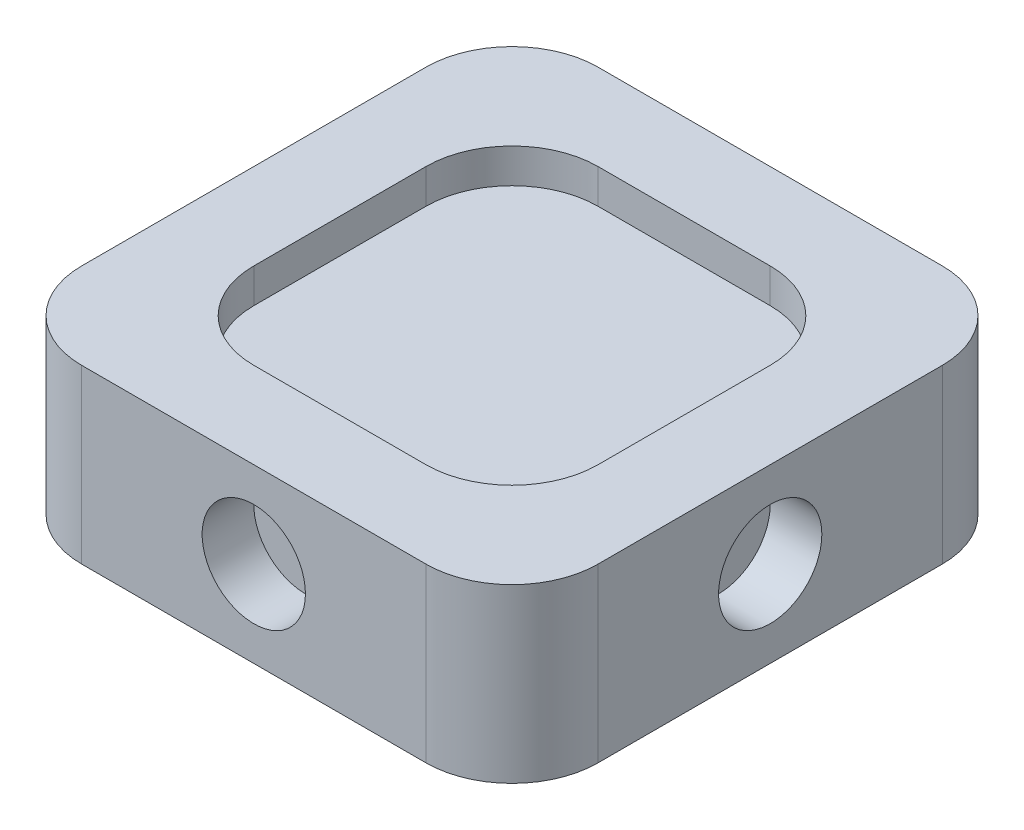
ISO-10303-21;
HEADER;
FILE_DESCRIPTION(('STEP AP214'),'2;1');
FILE_NAME('part.step','',(''),(''),'','','');
FILE_SCHEMA(('AUTOMOTIVE_DESIGN { 1 0 10303 214 1 1 1 1 }'));
ENDSEC;
DATA;
#1=APPLICATION_CONTEXT('core data for automotive mechanical design processes');
#2=APPLICATION_PROTOCOL_DEFINITION('international standard','automotive_design',2000,#1);
#3=PRODUCT_CONTEXT('',#1,'mechanical');
#4=PRODUCT('Part','Part','',(#3));
#5=PRODUCT_RELATED_PRODUCT_CATEGORY('part','',(#4));
#6=PRODUCT_DEFINITION_FORMATION('','',#4);
#7=PRODUCT_DEFINITION_CONTEXT('part definition',#1,'design');
#8=PRODUCT_DEFINITION('design','',#6,#7);
#9=PRODUCT_DEFINITION_SHAPE('','',#8);
#10=(LENGTH_UNIT() NAMED_UNIT(*) SI_UNIT(.MILLI.,.METRE.));
#11=(NAMED_UNIT(*) PLANE_ANGLE_UNIT() SI_UNIT($,.RADIAN.));
#12=(NAMED_UNIT(*) SI_UNIT($,.STERADIAN.) SOLID_ANGLE_UNIT());
#13=UNCERTAINTY_MEASURE_WITH_UNIT(LENGTH_MEASURE(1.E-05),#10,'distance_accuracy_value','');
#14=(GEOMETRIC_REPRESENTATION_CONTEXT(3) GLOBAL_UNCERTAINTY_ASSIGNED_CONTEXT((#13)) GLOBAL_UNIT_ASSIGNED_CONTEXT((#10,
#11,#12)) REPRESENTATION_CONTEXT('',''));
#15=CARTESIAN_POINT('',(0.,0.,0.));
#16=DIRECTION('',(0.,0.,1.));
#17=DIRECTION('',(1.,0.,0.));
#18=AXIS2_PLACEMENT_3D('',#15,#16,#17);
#19=CARTESIAN_POINT('',(15.,10.,-15.));
#20=DIRECTION('',(-1.,0.,0.));
#21=DIRECTION('',(0.,0.,1.));
#22=AXIS2_PLACEMENT_3D('',#19,#20,#21);
#23=PLANE('',#22);
#24=CARTESIAN_POINT('',(15.,5.,0.));
#25=DIRECTION('',(1.,0.,0.));
#26=DIRECTION('',(0.,0.,-1.));
#27=AXIS2_PLACEMENT_3D('',#24,#25,#26);
#28=CIRCLE('',#27,3.);
#29=CARTESIAN_POINT('',(15.,5.,-3.));
#30=VERTEX_POINT('',#29);
#31=EDGE_CURVE('E476',#30,#30,#28,.T.);
#32=ORIENTED_EDGE('',*,*,#31,.F.);
#33=EDGE_LOOP('',(#32));
#34=FACE_BOUND('',#33,.T.);
#35=DIRECTION('',(0.,0.,-1.));
#36=VECTOR('',#35,1.);
#37=CARTESIAN_POINT('',(15.,0.,-15.));
#38=LINE('',#37,#36);
#39=CARTESIAN_POINT('',(15.,0.,10.));
#40=VERTEX_POINT('',#39);
#41=CARTESIAN_POINT('',(15.,0.,-10.));
#42=VERTEX_POINT('',#41);
#43=EDGE_CURVE('E243',#40,#42,#38,.T.);
#44=ORIENTED_EDGE('',*,*,#43,.T.);
#45=DIRECTION('',(0.,-1.,0.));
#46=VECTOR('',#45,1.);
#47=CARTESIAN_POINT('',(15.,10.,-10.));
#48=LINE('',#47,#46);
#49=CARTESIAN_POINT('',(15.,10.,-10.));
#50=VERTEX_POINT('',#49);
#51=EDGE_CURVE('E278',#42,#50,#48,.F.);
#52=ORIENTED_EDGE('',*,*,#51,.T.);
#53=DIRECTION('',(0.,0.,-1.));
#54=VECTOR('',#53,1.);
#55=CARTESIAN_POINT('',(15.,10.,-15.));
#56=LINE('',#55,#54);
#57=CARTESIAN_POINT('',(15.,10.,10.));
#58=VERTEX_POINT('',#57);
#59=EDGE_CURVE('E241',#58,#50,#56,.T.);
#60=ORIENTED_EDGE('',*,*,#59,.F.);
#61=DIRECTION('',(0.,-1.,0.));
#62=VECTOR('',#61,1.);
#63=CARTESIAN_POINT('',(15.,10.,10.));
#64=LINE('',#63,#62);
#65=EDGE_CURVE('E274',#58,#40,#64,.T.);
#66=ORIENTED_EDGE('',*,*,#65,.T.);
#67=EDGE_LOOP('',(#44,#52,#60,#66));
#68=FACE_BOUND('',#67,.T.);
#69=ADVANCED_FACE('F45',(#34,#68),#23,.F.);
#70=CARTESIAN_POINT('',(-15.,10.,-15.));
#71=DIRECTION('',(0.,0.,1.));
#72=DIRECTION('',(1.,0.,0.));
#73=AXIS2_PLACEMENT_3D('',#70,#71,#72);
#74=PLANE('',#73);
#75=CARTESIAN_POINT('',(0.,5.,-15.));
#76=DIRECTION('',(0.,0.,-1.));
#77=DIRECTION('',(-1.,0.,0.));
#78=AXIS2_PLACEMENT_3D('',#75,#76,#77);
#79=CIRCLE('',#78,3.);
#80=CARTESIAN_POINT('',(-3.,5.,-15.));
#81=VERTEX_POINT('',#80);
#82=EDGE_CURVE('E468',#81,#81,#79,.T.);
#83=ORIENTED_EDGE('',*,*,#82,.F.);
#84=EDGE_LOOP('',(#83));
#85=FACE_BOUND('',#84,.T.);
#86=DIRECTION('',(-1.,0.,0.));
#87=VECTOR('',#86,1.);
#88=CARTESIAN_POINT('',(-15.,0.,-15.));
#89=LINE('',#88,#87);
#90=CARTESIAN_POINT('',(10.,0.,-15.));
#91=VERTEX_POINT('',#90);
#92=CARTESIAN_POINT('',(-10.,0.,-15.));
#93=VERTEX_POINT('',#92);
#94=EDGE_CURVE('E236',#91,#93,#89,.T.);
#95=ORIENTED_EDGE('',*,*,#94,.T.);
#96=DIRECTION('',(0.,-1.,0.));
#97=VECTOR('',#96,1.);
#98=CARTESIAN_POINT('',(-10.,10.,-15.));
#99=LINE('',#98,#97);
#100=CARTESIAN_POINT('',(-10.,10.,-15.));
#101=VERTEX_POINT('',#100);
#102=EDGE_CURVE('E211',#93,#101,#99,.F.);
#103=ORIENTED_EDGE('',*,*,#102,.T.);
#104=DIRECTION('',(-1.,0.,0.));
#105=VECTOR('',#104,1.);
#106=CARTESIAN_POINT('',(-15.,10.,-15.));
#107=LINE('',#106,#105);
#108=CARTESIAN_POINT('',(10.,10.,-15.));
#109=VERTEX_POINT('',#108);
#110=EDGE_CURVE('E498',#109,#101,#107,.T.);
#111=ORIENTED_EDGE('',*,*,#110,.F.);
#112=DIRECTION('',(0.,-1.,0.));
#113=VECTOR('',#112,1.);
#114=CARTESIAN_POINT('',(10.,10.,-15.));
#115=LINE('',#114,#113);
#116=EDGE_CURVE('E217',#109,#91,#115,.T.);
#117=ORIENTED_EDGE('',*,*,#116,.T.);
#118=EDGE_LOOP('',(#95,#103,#111,#117));
#119=FACE_BOUND('',#118,.T.);
#120=ADVANCED_FACE('F521',(#85,#119),#74,.F.);
#121=CARTESIAN_POINT('',(-15.,10.,-15.));
#122=DIRECTION('',(1.,0.,0.));
#123=DIRECTION('',(0.,0.,-1.));
#124=AXIS2_PLACEMENT_3D('',#121,#122,#123);
#125=PLANE('',#124);
#126=CARTESIAN_POINT('',(-15.,5.,0.));
#127=DIRECTION('',(-1.,0.,0.));
#128=DIRECTION('',(0.,0.,1.));
#129=AXIS2_PLACEMENT_3D('',#126,#127,#128);
#130=CIRCLE('',#129,3.);
#131=CARTESIAN_POINT('',(-15.,5.,3.));
#132=VERTEX_POINT('',#131);
#133=EDGE_CURVE('E449',#132,#132,#130,.T.);
#134=ORIENTED_EDGE('',*,*,#133,.F.);
#135=EDGE_LOOP('',(#134));
#136=FACE_BOUND('',#135,.T.);
#137=DIRECTION('',(0.,0.,1.));
#138=VECTOR('',#137,1.);
#139=CARTESIAN_POINT('',(-15.,10.,-15.));
#140=LINE('',#139,#138);
#141=CARTESIAN_POINT('',(-15.,10.,-10.));
#142=VERTEX_POINT('',#141);
#143=CARTESIAN_POINT('',(-15.,10.,10.));
#144=VERTEX_POINT('',#143);
#145=EDGE_CURVE('E227',#142,#144,#140,.T.);
#146=ORIENTED_EDGE('',*,*,#145,.F.);
#147=DIRECTION('',(0.,-1.,0.));
#148=VECTOR('',#147,1.);
#149=CARTESIAN_POINT('',(-15.,10.,-10.));
#150=LINE('',#149,#148);
#151=CARTESIAN_POINT('',(-15.,0.,-10.));
#152=VERTEX_POINT('',#151);
#153=EDGE_CURVE('E210',#142,#152,#150,.T.);
#154=ORIENTED_EDGE('',*,*,#153,.T.);
#155=DIRECTION('',(0.,0.,1.));
#156=VECTOR('',#155,1.);
#157=CARTESIAN_POINT('',(-15.,0.,-15.));
#158=LINE('',#157,#156);
#159=CARTESIAN_POINT('',(-15.,0.,10.));
#160=VERTEX_POINT('',#159);
#161=EDGE_CURVE('E224',#152,#160,#158,.T.);
#162=ORIENTED_EDGE('',*,*,#161,.T.);
#163=DIRECTION('',(0.,-1.,0.));
#164=VECTOR('',#163,1.);
#165=CARTESIAN_POINT('',(-15.,10.,10.));
#166=LINE('',#165,#164);
#167=EDGE_CURVE('E230',#160,#144,#166,.F.);
#168=ORIENTED_EDGE('',*,*,#167,.T.);
#169=EDGE_LOOP('',(#146,#154,#162,#168));
#170=FACE_BOUND('',#169,.T.);
#171=ADVANCED_FACE('F223',(#136,#170),#125,.F.);
#172=CARTESIAN_POINT('',(-15.,10.,15.));
#173=DIRECTION('',(0.,0.,-1.));
#174=DIRECTION('',(-1.,0.,0.));
#175=AXIS2_PLACEMENT_3D('',#172,#173,#174);
#176=PLANE('',#175);
#177=CARTESIAN_POINT('',(0.,5.,15.));
#178=DIRECTION('',(0.,0.,1.));
#179=DIRECTION('',(1.,0.,0.));
#180=AXIS2_PLACEMENT_3D('',#177,#178,#179);
#181=CIRCLE('',#180,3.);
#182=CARTESIAN_POINT('',(3.,5.,15.));
#183=VERTEX_POINT('',#182);
#184=EDGE_CURVE('E484',#183,#183,#181,.T.);
#185=ORIENTED_EDGE('',*,*,#184,.F.);
#186=EDGE_LOOP('',(#185));
#187=FACE_BOUND('',#186,.T.);
#188=DIRECTION('',(1.,0.,0.));
#189=VECTOR('',#188,1.);
#190=CARTESIAN_POINT('',(-15.,0.,15.));
#191=LINE('',#190,#189);
#192=CARTESIAN_POINT('',(-9.99999999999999,0.,15.));
#193=VERTEX_POINT('',#192);
#194=CARTESIAN_POINT('',(10.,0.,15.));
#195=VERTEX_POINT('',#194);
#196=EDGE_CURVE('E235',#193,#195,#191,.T.);
#197=ORIENTED_EDGE('',*,*,#196,.T.);
#198=DIRECTION('',(0.,-1.,0.));
#199=VECTOR('',#198,1.);
#200=CARTESIAN_POINT('',(10.,10.,15.));
#201=LINE('',#200,#199);
#202=CARTESIAN_POINT('',(10.,10.,15.));
#203=VERTEX_POINT('',#202);
#204=EDGE_CURVE('E285',#195,#203,#201,.F.);
#205=ORIENTED_EDGE('',*,*,#204,.T.);
#206=DIRECTION('',(1.,0.,0.));
#207=VECTOR('',#206,1.);
#208=CARTESIAN_POINT('',(-15.,10.,15.));
#209=LINE('',#208,#207);
#210=CARTESIAN_POINT('',(-9.99999999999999,10.,15.));
#211=VERTEX_POINT('',#210);
#212=EDGE_CURVE('E248',#211,#203,#209,.T.);
#213=ORIENTED_EDGE('',*,*,#212,.F.);
#214=DIRECTION('',(0.,-1.,0.));
#215=VECTOR('',#214,1.);
#216=CARTESIAN_POINT('',(-9.99999999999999,10.,15.));
#217=LINE('',#216,#215);
#218=EDGE_CURVE('E281',#211,#193,#217,.T.);
#219=ORIENTED_EDGE('',*,*,#218,.T.);
#220=EDGE_LOOP('',(#197,#205,#213,#219));
#221=FACE_BOUND('',#220,.T.);
#222=ADVANCED_FACE('F529',(#187,#221),#176,.F.);
#223=CARTESIAN_POINT('',(0.,10.,0.));
#224=DIRECTION('',(0.,1.,0.));
#225=DIRECTION('',(0.,0.,1.));
#226=AXIS2_PLACEMENT_3D('',#223,#224,#225);
#227=PLANE('',#226);
#228=DIRECTION('',(0.,0.,-1.));
#229=VECTOR('',#228,1.);
#230=CARTESIAN_POINT('',(10.,10.,10.));
#231=LINE('',#230,#229);
#232=CARTESIAN_POINT('',(10.,10.,5.));
#233=VERTEX_POINT('',#232);
#234=CARTESIAN_POINT('',(10.,10.,-5.));
#235=VERTEX_POINT('',#234);
#236=EDGE_CURVE('E421',#233,#235,#231,.T.);
#237=ORIENTED_EDGE('',*,*,#236,.F.);
#238=CARTESIAN_POINT('',(5.,10.,5.));
#239=DIRECTION('',(0.,1.,0.));
#240=DIRECTION('',(0.,0.,1.));
#241=AXIS2_PLACEMENT_3D('',#238,#239,#240);
#242=CIRCLE('',#241,5.);
#243=CARTESIAN_POINT('',(5.,10.,10.));
#244=VERTEX_POINT('',#243);
#245=EDGE_CURVE('E328',#233,#244,#242,.F.);
#246=ORIENTED_EDGE('',*,*,#245,.T.);
#247=DIRECTION('',(1.,0.,0.));
#248=VECTOR('',#247,1.);
#249=CARTESIAN_POINT('',(-9.99999999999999,10.,10.));
#250=LINE('',#249,#248);
#251=CARTESIAN_POINT('',(-5.,10.,10.));
#252=VERTEX_POINT('',#251);
#253=EDGE_CURVE('E437',#252,#244,#250,.T.);
#254=ORIENTED_EDGE('',*,*,#253,.F.);
#255=CARTESIAN_POINT('',(-5.,10.,5.));
#256=DIRECTION('',(0.,1.,0.));
#257=DIRECTION('',(0.,0.,1.));
#258=AXIS2_PLACEMENT_3D('',#255,#256,#257);
#259=CIRCLE('',#258,5.);
#260=CARTESIAN_POINT('',(-9.99999999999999,10.,5.));
#261=VERTEX_POINT('',#260);
#262=EDGE_CURVE('E334',#252,#261,#259,.F.);
#263=ORIENTED_EDGE('',*,*,#262,.T.);
#264=DIRECTION('',(0.,0.,1.));
#265=VECTOR('',#264,1.);
#266=CARTESIAN_POINT('',(-10.,10.,-10.));
#267=LINE('',#266,#265);
#268=CARTESIAN_POINT('',(-10.,10.,-5.));
#269=VERTEX_POINT('',#268);
#270=EDGE_CURVE('E457',#269,#261,#267,.T.);
#271=ORIENTED_EDGE('',*,*,#270,.F.);
#272=CARTESIAN_POINT('',(-5.,10.,-5.));
#273=DIRECTION('',(0.,1.,0.));
#274=DIRECTION('',(0.,0.,1.));
#275=AXIS2_PLACEMENT_3D('',#272,#273,#274);
#276=CIRCLE('',#275,5.);
#277=CARTESIAN_POINT('',(-5.,10.,-10.));
#278=VERTEX_POINT('',#277);
#279=EDGE_CURVE('E337',#269,#278,#276,.F.);
#280=ORIENTED_EDGE('',*,*,#279,.T.);
#281=DIRECTION('',(-1.,0.,0.));
#282=VECTOR('',#281,1.);
#283=CARTESIAN_POINT('',(10.,10.,-10.));
#284=LINE('',#283,#282);
#285=CARTESIAN_POINT('',(5.,10.,-10.));
#286=VERTEX_POINT('',#285);
#287=EDGE_CURVE('E453',#286,#278,#284,.T.);
#288=ORIENTED_EDGE('',*,*,#287,.F.);
#289=CARTESIAN_POINT('',(5.,10.,-5.));
#290=DIRECTION('',(0.,1.,0.));
#291=DIRECTION('',(0.,0.,1.));
#292=AXIS2_PLACEMENT_3D('',#289,#290,#291);
#293=CIRCLE('',#292,5.);
#294=EDGE_CURVE('E331',#286,#235,#293,.F.);
#295=ORIENTED_EDGE('',*,*,#294,.T.);
#296=EDGE_LOOP('',(#237,#246,#254,#263,#271,#280,#288,#295));
#297=FACE_BOUND('',#296,.T.);
#298=ORIENTED_EDGE('',*,*,#110,.T.);
#299=CARTESIAN_POINT('',(-10.,10.,-10.));
#300=DIRECTION('',(0.,1.,0.));
#301=DIRECTION('',(0.,0.,1.));
#302=AXIS2_PLACEMENT_3D('',#299,#300,#301);
#303=CIRCLE('',#302,5.);
#304=EDGE_CURVE('E271',#101,#142,#303,.T.);
#305=ORIENTED_EDGE('',*,*,#304,.T.);
#306=ORIENTED_EDGE('',*,*,#145,.T.);
#307=CARTESIAN_POINT('',(-9.99999999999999,10.,10.));
#308=DIRECTION('',(0.,1.,0.));
#309=DIRECTION('',(0.,0.,1.));
#310=AXIS2_PLACEMENT_3D('',#307,#308,#309);
#311=CIRCLE('',#310,5.);
#312=EDGE_CURVE('E262',#144,#211,#311,.T.);
#313=ORIENTED_EDGE('',*,*,#312,.T.);
#314=ORIENTED_EDGE('',*,*,#212,.T.);
#315=CARTESIAN_POINT('',(10.,10.,10.));
#316=DIRECTION('',(0.,1.,0.));
#317=DIRECTION('',(0.,0.,1.));
#318=AXIS2_PLACEMENT_3D('',#315,#316,#317);
#319=CIRCLE('',#318,5.);
#320=EDGE_CURVE('E265',#203,#58,#319,.T.);
#321=ORIENTED_EDGE('',*,*,#320,.T.);
#322=ORIENTED_EDGE('',*,*,#59,.T.);
#323=CARTESIAN_POINT('',(10.,10.,-10.));
#324=DIRECTION('',(0.,1.,0.));
#325=DIRECTION('',(0.,0.,1.));
#326=AXIS2_PLACEMENT_3D('',#323,#324,#325);
#327=CIRCLE('',#326,5.);
#328=EDGE_CURVE('E268',#50,#109,#327,.T.);
#329=ORIENTED_EDGE('',*,*,#328,.T.);
#330=EDGE_LOOP('',(#298,#305,#306,#313,#314,#321,#322,#329));
#331=FACE_BOUND('',#330,.T.);
#332=ADVANCED_FACE('F519',(#297,#331),#227,.T.);
#333=CARTESIAN_POINT('',(0.,0.,0.));
#334=DIRECTION('',(0.,1.,0.));
#335=DIRECTION('',(0.,0.,1.));
#336=AXIS2_PLACEMENT_3D('',#333,#334,#335);
#337=PLANE('',#336);
#338=DIRECTION('',(-1.,0.,0.));
#339=VECTOR('',#338,1.);
#340=CARTESIAN_POINT('',(-10.,0.,10.));
#341=LINE('',#340,#339);
#342=CARTESIAN_POINT('',(5.,0.,10.));
#343=VERTEX_POINT('',#342);
#344=CARTESIAN_POINT('',(-5.,0.,10.));
#345=VERTEX_POINT('',#344);
#346=EDGE_CURVE('E388',#343,#345,#341,.T.);
#347=ORIENTED_EDGE('',*,*,#346,.F.);
#348=CARTESIAN_POINT('',(5.,0.,5.));
#349=DIRECTION('',(0.,1.,0.));
#350=DIRECTION('',(0.,0.,1.));
#351=AXIS2_PLACEMENT_3D('',#348,#349,#350);
#352=CIRCLE('',#351,5.);
#353=CARTESIAN_POINT('',(10.,0.,5.));
#354=VERTEX_POINT('',#353);
#355=EDGE_CURVE('E54',#343,#354,#352,.T.);
#356=ORIENTED_EDGE('',*,*,#355,.T.);
#357=DIRECTION('',(0.,0.,1.));
#358=VECTOR('',#357,1.);
#359=CARTESIAN_POINT('',(10.,0.,10.));
#360=LINE('',#359,#358);
#361=CARTESIAN_POINT('',(10.,0.,-5.));
#362=VERTEX_POINT('',#361);
#363=EDGE_CURVE('E387',#362,#354,#360,.T.);
#364=ORIENTED_EDGE('',*,*,#363,.F.);
#365=CARTESIAN_POINT('',(5.,0.,-5.));
#366=DIRECTION('',(0.,1.,0.));
#367=DIRECTION('',(0.,0.,1.));
#368=AXIS2_PLACEMENT_3D('',#365,#366,#367);
#369=CIRCLE('',#368,5.);
#370=CARTESIAN_POINT('',(5.,0.,-10.));
#371=VERTEX_POINT('',#370);
#372=EDGE_CURVE('E379',#362,#371,#369,.T.);
#373=ORIENTED_EDGE('',*,*,#372,.T.);
#374=DIRECTION('',(1.,0.,0.));
#375=VECTOR('',#374,1.);
#376=CARTESIAN_POINT('',(-10.,0.,-10.));
#377=LINE('',#376,#375);
#378=CARTESIAN_POINT('',(-5.,0.,-10.));
#379=VERTEX_POINT('',#378);
#380=EDGE_CURVE('E417',#379,#371,#377,.T.);
#381=ORIENTED_EDGE('',*,*,#380,.F.);
#382=CARTESIAN_POINT('',(-5.,0.,-5.));
#383=DIRECTION('',(0.,1.,0.));
#384=DIRECTION('',(0.,0.,1.));
#385=AXIS2_PLACEMENT_3D('',#382,#383,#384);
#386=CIRCLE('',#385,5.);
#387=CARTESIAN_POINT('',(-10.,0.,-5.));
#388=VERTEX_POINT('',#387);
#389=EDGE_CURVE('E382',#379,#388,#386,.T.);
#390=ORIENTED_EDGE('',*,*,#389,.T.);
#391=DIRECTION('',(0.,0.,-1.));
#392=VECTOR('',#391,1.);
#393=CARTESIAN_POINT('',(-10.,0.,10.));
#394=LINE('',#393,#392);
#395=CARTESIAN_POINT('',(-10.,0.,5.));
#396=VERTEX_POINT('',#395);
#397=EDGE_CURVE('E425',#396,#388,#394,.T.);
#398=ORIENTED_EDGE('',*,*,#397,.F.);
#399=CARTESIAN_POINT('',(-5.,0.,5.));
#400=DIRECTION('',(0.,1.,0.));
#401=DIRECTION('',(0.,0.,1.));
#402=AXIS2_PLACEMENT_3D('',#399,#400,#401);
#403=CIRCLE('',#402,5.);
#404=EDGE_CURVE('E11',#396,#345,#403,.T.);
#405=ORIENTED_EDGE('',*,*,#404,.T.);
#406=EDGE_LOOP('',(#347,#356,#364,#373,#381,#390,#398,#405));
#407=FACE_BOUND('',#406,.T.);
#408=ORIENTED_EDGE('',*,*,#161,.F.);
#409=CARTESIAN_POINT('',(-10.,0.,-10.));
#410=DIRECTION('',(0.,1.,0.));
#411=DIRECTION('',(0.,0.,1.));
#412=AXIS2_PLACEMENT_3D('',#409,#410,#411);
#413=CIRCLE('',#412,5.);
#414=EDGE_CURVE('E206',#152,#93,#413,.F.);
#415=ORIENTED_EDGE('',*,*,#414,.T.);
#416=ORIENTED_EDGE('',*,*,#94,.F.);
#417=CARTESIAN_POINT('',(10.,0.,-10.));
#418=DIRECTION('',(0.,1.,0.));
#419=DIRECTION('',(0.,0.,1.));
#420=AXIS2_PLACEMENT_3D('',#417,#418,#419);
#421=CIRCLE('',#420,5.);
#422=EDGE_CURVE('E218',#91,#42,#421,.F.);
#423=ORIENTED_EDGE('',*,*,#422,.T.);
#424=ORIENTED_EDGE('',*,*,#43,.F.);
#425=CARTESIAN_POINT('',(10.,0.,10.));
#426=DIRECTION('',(0.,1.,0.));
#427=DIRECTION('',(0.,0.,1.));
#428=AXIS2_PLACEMENT_3D('',#425,#426,#427);
#429=CIRCLE('',#428,5.);
#430=EDGE_CURVE('E252',#40,#195,#429,.F.);
#431=ORIENTED_EDGE('',*,*,#430,.T.);
#432=ORIENTED_EDGE('',*,*,#196,.F.);
#433=CARTESIAN_POINT('',(-9.99999999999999,0.,10.));
#434=DIRECTION('',(0.,1.,0.));
#435=DIRECTION('',(0.,0.,1.));
#436=AXIS2_PLACEMENT_3D('',#433,#434,#435);
#437=CIRCLE('',#436,5.);
#438=EDGE_CURVE('E229',#193,#160,#437,.F.);
#439=ORIENTED_EDGE('',*,*,#438,.T.);
#440=EDGE_LOOP('',(#408,#415,#416,#423,#424,#431,#432,#439));
#441=FACE_BOUND('',#440,.T.);
#442=ADVANCED_FACE('F232',(#407,#441),#337,.F.);
#443=CARTESIAN_POINT('',(0.,5.,12.));
#444=DIRECTION('',(0.,0.,1.));
#445=DIRECTION('',(1.,0.,0.));
#446=AXIS2_PLACEMENT_3D('',#443,#444,#445);
#447=CYLINDRICAL_SURFACE('',#446,3.);
#448=CARTESIAN_POINT('',(0.,5.,12.));
#449=DIRECTION('',(0.,0.,1.));
#450=DIRECTION('',(1.,0.,0.));
#451=AXIS2_PLACEMENT_3D('',#448,#449,#450);
#452=CIRCLE('',#451,3.);
#453=CARTESIAN_POINT('',(3.,5.,12.));
#454=VERTEX_POINT('',#453);
#455=EDGE_CURVE('E488',#454,#454,#452,.T.);
#456=ORIENTED_EDGE('',*,*,#455,.F.);
#457=EDGE_LOOP('',(#456));
#458=FACE_BOUND('',#457,.T.);
#459=ORIENTED_EDGE('',*,*,#184,.T.);
#460=EDGE_LOOP('',(#459));
#461=FACE_BOUND('',#460,.T.);
#462=ADVANCED_FACE('F651',(#458,#461),#447,.F.);
#463=CARTESIAN_POINT('',(0.,5.,12.));
#464=DIRECTION('',(0.,0.,1.));
#465=DIRECTION('',(1.,0.,0.));
#466=AXIS2_PLACEMENT_3D('',#463,#464,#465);
#467=PLANE('',#466);
#468=ORIENTED_EDGE('',*,*,#455,.T.);
#469=EDGE_LOOP('',(#468));
#470=FACE_BOUND('',#469,.T.);
#471=ADVANCED_FACE('F647',(#470),#467,.T.);
#472=CARTESIAN_POINT('',(12.,5.,0.));
#473=DIRECTION('',(1.,0.,0.));
#474=DIRECTION('',(0.,0.,-1.));
#475=AXIS2_PLACEMENT_3D('',#472,#473,#474);
#476=CYLINDRICAL_SURFACE('',#475,3.);
#477=CARTESIAN_POINT('',(12.,5.,0.));
#478=DIRECTION('',(1.,0.,0.));
#479=DIRECTION('',(0.,0.,-1.));
#480=AXIS2_PLACEMENT_3D('',#477,#478,#479);
#481=CIRCLE('',#480,3.);
#482=CARTESIAN_POINT('',(12.,5.,-3.));
#483=VERTEX_POINT('',#482);
#484=EDGE_CURVE('E480',#483,#483,#481,.T.);
#485=ORIENTED_EDGE('',*,*,#484,.F.);
#486=EDGE_LOOP('',(#485));
#487=FACE_BOUND('',#486,.T.);
#488=ORIENTED_EDGE('',*,*,#31,.T.);
#489=EDGE_LOOP('',(#488));
#490=FACE_BOUND('',#489,.T.);
#491=ADVANCED_FACE('F643',(#487,#490),#476,.F.);
#492=CARTESIAN_POINT('',(12.,5.,0.));
#493=DIRECTION('',(1.,0.,0.));
#494=DIRECTION('',(0.,0.,-1.));
#495=AXIS2_PLACEMENT_3D('',#492,#493,#494);
#496=PLANE('',#495);
#497=ORIENTED_EDGE('',*,*,#484,.T.);
#498=EDGE_LOOP('',(#497));
#499=FACE_BOUND('',#498,.T.);
#500=ADVANCED_FACE('F639',(#499),#496,.T.);
#501=CARTESIAN_POINT('',(0.,5.,-12.));
#502=DIRECTION('',(0.,0.,-1.));
#503=DIRECTION('',(-1.,0.,0.));
#504=AXIS2_PLACEMENT_3D('',#501,#502,#503);
#505=CYLINDRICAL_SURFACE('',#504,3.);
#506=CARTESIAN_POINT('',(0.,5.,-12.));
#507=DIRECTION('',(0.,0.,-1.));
#508=DIRECTION('',(-1.,0.,0.));
#509=AXIS2_PLACEMENT_3D('',#506,#507,#508);
#510=CIRCLE('',#509,3.);
#511=CARTESIAN_POINT('',(-3.,5.,-12.));
#512=VERTEX_POINT('',#511);
#513=EDGE_CURVE('E472',#512,#512,#510,.T.);
#514=ORIENTED_EDGE('',*,*,#513,.F.);
#515=EDGE_LOOP('',(#514));
#516=FACE_BOUND('',#515,.T.);
#517=ORIENTED_EDGE('',*,*,#82,.T.);
#518=EDGE_LOOP('',(#517));
#519=FACE_BOUND('',#518,.T.);
#520=ADVANCED_FACE('F635',(#516,#519),#505,.F.);
#521=CARTESIAN_POINT('',(0.,5.,-12.));
#522=DIRECTION('',(0.,0.,-1.));
#523=DIRECTION('',(-1.,0.,0.));
#524=AXIS2_PLACEMENT_3D('',#521,#522,#523);
#525=PLANE('',#524);
#526=ORIENTED_EDGE('',*,*,#513,.T.);
#527=EDGE_LOOP('',(#526));
#528=FACE_BOUND('',#527,.T.);
#529=ADVANCED_FACE('F631',(#528),#525,.T.);
#530=CARTESIAN_POINT('',(-12.,5.,0.));
#531=DIRECTION('',(-1.,0.,0.));
#532=DIRECTION('',(0.,0.,1.));
#533=AXIS2_PLACEMENT_3D('',#530,#531,#532);
#534=CYLINDRICAL_SURFACE('',#533,3.);
#535=CARTESIAN_POINT('',(-12.,5.,0.));
#536=DIRECTION('',(-1.,0.,0.));
#537=DIRECTION('',(0.,0.,1.));
#538=AXIS2_PLACEMENT_3D('',#535,#536,#537);
#539=CIRCLE('',#538,3.);
#540=CARTESIAN_POINT('',(-12.,5.,3.));
#541=VERTEX_POINT('',#540);
#542=EDGE_CURVE('E464',#541,#541,#539,.T.);
#543=ORIENTED_EDGE('',*,*,#542,.F.);
#544=EDGE_LOOP('',(#543));
#545=FACE_BOUND('',#544,.T.);
#546=ORIENTED_EDGE('',*,*,#133,.T.);
#547=EDGE_LOOP('',(#546));
#548=FACE_BOUND('',#547,.T.);
#549=ADVANCED_FACE('F627',(#545,#548),#534,.F.);
#550=CARTESIAN_POINT('',(-12.,5.,0.));
#551=DIRECTION('',(-1.,0.,0.));
#552=DIRECTION('',(0.,0.,1.));
#553=AXIS2_PLACEMENT_3D('',#550,#551,#552);
#554=PLANE('',#553);
#555=ORIENTED_EDGE('',*,*,#542,.T.);
#556=EDGE_LOOP('',(#555));
#557=FACE_BOUND('',#556,.T.);
#558=ADVANCED_FACE('F539',(#557),#554,.T.);
#559=CARTESIAN_POINT('',(-10.,10.,-10.));
#560=DIRECTION('',(0.,-1.,0.));
#561=DIRECTION('',(0.,0.,-1.));
#562=AXIS2_PLACEMENT_3D('',#559,#560,#561);
#563=CYLINDRICAL_SURFACE('',#562,5.);
#564=ORIENTED_EDGE('',*,*,#304,.F.);
#565=ORIENTED_EDGE('',*,*,#102,.F.);
#566=ORIENTED_EDGE('',*,*,#414,.F.);
#567=ORIENTED_EDGE('',*,*,#153,.F.);
#568=EDGE_LOOP('',(#564,#565,#566,#567));
#569=FACE_BOUND('',#568,.T.);
#570=ADVANCED_FACE('F209',(#569),#563,.T.);
#571=CARTESIAN_POINT('',(10.,10.,-10.));
#572=DIRECTION('',(0.,-1.,0.));
#573=DIRECTION('',(0.,0.,-1.));
#574=AXIS2_PLACEMENT_3D('',#571,#572,#573);
#575=CYLINDRICAL_SURFACE('',#574,5.);
#576=ORIENTED_EDGE('',*,*,#328,.F.);
#577=ORIENTED_EDGE('',*,*,#51,.F.);
#578=ORIENTED_EDGE('',*,*,#422,.F.);
#579=ORIENTED_EDGE('',*,*,#116,.F.);
#580=EDGE_LOOP('',(#576,#577,#578,#579));
#581=FACE_BOUND('',#580,.T.);
#582=ADVANCED_FACE('F515',(#581),#575,.T.);
#583=CARTESIAN_POINT('',(10.,10.,10.));
#584=DIRECTION('',(0.,-1.,0.));
#585=DIRECTION('',(0.,0.,-1.));
#586=AXIS2_PLACEMENT_3D('',#583,#584,#585);
#587=CYLINDRICAL_SURFACE('',#586,5.);
#588=ORIENTED_EDGE('',*,*,#320,.F.);
#589=ORIENTED_EDGE('',*,*,#204,.F.);
#590=ORIENTED_EDGE('',*,*,#430,.F.);
#591=ORIENTED_EDGE('',*,*,#65,.F.);
#592=EDGE_LOOP('',(#588,#589,#590,#591));
#593=FACE_BOUND('',#592,.T.);
#594=ADVANCED_FACE('F542',(#593),#587,.T.);
#595=CARTESIAN_POINT('',(-9.99999999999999,10.,10.));
#596=DIRECTION('',(0.,-1.,0.));
#597=DIRECTION('',(0.,0.,-1.));
#598=AXIS2_PLACEMENT_3D('',#595,#596,#597);
#599=CYLINDRICAL_SURFACE('',#598,5.);
#600=ORIENTED_EDGE('',*,*,#312,.F.);
#601=ORIENTED_EDGE('',*,*,#167,.F.);
#602=ORIENTED_EDGE('',*,*,#438,.F.);
#603=ORIENTED_EDGE('',*,*,#218,.F.);
#604=EDGE_LOOP('',(#600,#601,#602,#603));
#605=FACE_BOUND('',#604,.T.);
#606=ADVANCED_FACE('F545',(#605),#599,.T.);
#607=CARTESIAN_POINT('',(10.,8.,10.));
#608=DIRECTION('',(1.,0.,0.));
#609=DIRECTION('',(0.,0.,-1.));
#610=AXIS2_PLACEMENT_3D('',#607,#608,#609);
#611=PLANE('',#610);
#612=DIRECTION('',(0.,0.,-1.));
#613=VECTOR('',#612,1.);
#614=CARTESIAN_POINT('',(10.,8.,10.));
#615=LINE('',#614,#613);
#616=CARTESIAN_POINT('',(10.,8.,5.));
#617=VERTEX_POINT('',#616);
#618=CARTESIAN_POINT('',(10.,8.,-5.));
#619=VERTEX_POINT('',#618);
#620=EDGE_CURVE('E432',#617,#619,#615,.T.);
#621=ORIENTED_EDGE('',*,*,#620,.F.);
#622=DIRECTION('',(0.,1.,0.));
#623=VECTOR('',#622,1.);
#624=CARTESIAN_POINT('',(10.,10.,5.));
#625=LINE('',#624,#623);
#626=EDGE_CURVE('E291',#617,#233,#625,.T.);
#627=ORIENTED_EDGE('',*,*,#626,.T.);
#628=ORIENTED_EDGE('',*,*,#236,.T.);
#629=DIRECTION('',(0.,1.,0.));
#630=VECTOR('',#629,1.);
#631=CARTESIAN_POINT('',(10.,8.,-5.));
#632=LINE('',#631,#630);
#633=EDGE_CURVE('E288',#235,#619,#632,.F.);
#634=ORIENTED_EDGE('',*,*,#633,.T.);
#635=EDGE_LOOP('',(#621,#627,#628,#634));
#636=FACE_BOUND('',#635,.T.);
#637=ADVANCED_FACE('F549',(#636),#611,.F.);
#638=CARTESIAN_POINT('',(-9.99999999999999,8.,10.));
#639=DIRECTION('',(0.,0.,1.));
#640=DIRECTION('',(1.,0.,0.));
#641=AXIS2_PLACEMENT_3D('',#638,#639,#640);
#642=PLANE('',#641);
#643=ORIENTED_EDGE('',*,*,#253,.T.);
#644=DIRECTION('',(0.,1.,0.));
#645=VECTOR('',#644,1.);
#646=CARTESIAN_POINT('',(5.,8.,10.));
#647=LINE('',#646,#645);
#648=CARTESIAN_POINT('',(5.,8.,10.));
#649=VERTEX_POINT('',#648);
#650=EDGE_CURVE('E299',#244,#649,#647,.F.);
#651=ORIENTED_EDGE('',*,*,#650,.T.);
#652=DIRECTION('',(1.,0.,0.));
#653=VECTOR('',#652,1.);
#654=CARTESIAN_POINT('',(-9.99999999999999,8.,10.));
#655=LINE('',#654,#653);
#656=CARTESIAN_POINT('',(-5.,8.,10.));
#657=VERTEX_POINT('',#656);
#658=EDGE_CURVE('E445',#657,#649,#655,.T.);
#659=ORIENTED_EDGE('',*,*,#658,.F.);
#660=DIRECTION('',(0.,1.,0.));
#661=VECTOR('',#660,1.);
#662=CARTESIAN_POINT('',(-5.,10.,10.));
#663=LINE('',#662,#661);
#664=EDGE_CURVE('E295',#657,#252,#663,.T.);
#665=ORIENTED_EDGE('',*,*,#664,.T.);
#666=EDGE_LOOP('',(#643,#651,#659,#665));
#667=FACE_BOUND('',#666,.T.);
#668=ADVANCED_FACE('F611',(#667),#642,.F.);
#669=CARTESIAN_POINT('',(-10.,8.,-10.));
#670=DIRECTION('',(-1.,0.,0.));
#671=DIRECTION('',(0.,0.,1.));
#672=AXIS2_PLACEMENT_3D('',#669,#670,#671);
#673=PLANE('',#672);
#674=ORIENTED_EDGE('',*,*,#270,.T.);
#675=DIRECTION('',(0.,1.,0.));
#676=VECTOR('',#675,1.);
#677=CARTESIAN_POINT('',(-9.99999999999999,8.,5.));
#678=LINE('',#677,#676);
#679=CARTESIAN_POINT('',(-9.99999999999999,8.,5.));
#680=VERTEX_POINT('',#679);
#681=EDGE_CURVE('E325',#261,#680,#678,.F.);
#682=ORIENTED_EDGE('',*,*,#681,.T.);
#683=DIRECTION('',(0.,0.,1.));
#684=VECTOR('',#683,1.);
#685=CARTESIAN_POINT('',(-10.,8.,-10.));
#686=LINE('',#685,#684);
#687=CARTESIAN_POINT('',(-10.,8.,-5.));
#688=VERTEX_POINT('',#687);
#689=EDGE_CURVE('E441',#688,#680,#686,.T.);
#690=ORIENTED_EDGE('',*,*,#689,.F.);
#691=DIRECTION('',(0.,1.,0.));
#692=VECTOR('',#691,1.);
#693=CARTESIAN_POINT('',(-10.,10.,-5.));
#694=LINE('',#693,#692);
#695=EDGE_CURVE('E321',#688,#269,#694,.T.);
#696=ORIENTED_EDGE('',*,*,#695,.T.);
#697=EDGE_LOOP('',(#674,#682,#690,#696));
#698=FACE_BOUND('',#697,.T.);
#699=ADVANCED_FACE('F614',(#698),#673,.F.);
#700=CARTESIAN_POINT('',(10.,8.,-10.));
#701=DIRECTION('',(0.,0.,-1.));
#702=DIRECTION('',(-1.,0.,0.));
#703=AXIS2_PLACEMENT_3D('',#700,#701,#702);
#704=PLANE('',#703);
#705=DIRECTION('',(-1.,0.,0.));
#706=VECTOR('',#705,1.);
#707=CARTESIAN_POINT('',(10.,8.,-10.));
#708=LINE('',#707,#706);
#709=CARTESIAN_POINT('',(5.,8.,-10.));
#710=VERTEX_POINT('',#709);
#711=CARTESIAN_POINT('',(-5.,8.,-10.));
#712=VERTEX_POINT('',#711);
#713=EDGE_CURVE('E436',#710,#712,#708,.T.);
#714=ORIENTED_EDGE('',*,*,#713,.F.);
#715=DIRECTION('',(0.,1.,0.));
#716=VECTOR('',#715,1.);
#717=CARTESIAN_POINT('',(5.,10.,-10.));
#718=LINE('',#717,#716);
#719=EDGE_CURVE('E317',#710,#286,#718,.T.);
#720=ORIENTED_EDGE('',*,*,#719,.T.);
#721=ORIENTED_EDGE('',*,*,#287,.T.);
#722=DIRECTION('',(0.,1.,0.));
#723=VECTOR('',#722,1.);
#724=CARTESIAN_POINT('',(-5.,8.,-10.));
#725=LINE('',#724,#723);
#726=EDGE_CURVE('E314',#278,#712,#725,.F.);
#727=ORIENTED_EDGE('',*,*,#726,.T.);
#728=EDGE_LOOP('',(#714,#720,#721,#727));
#729=FACE_BOUND('',#728,.T.);
#730=ADVANCED_FACE('F609',(#729),#704,.F.);
#731=CARTESIAN_POINT('',(0.,8.,0.));
#732=DIRECTION('',(0.,1.,0.));
#733=DIRECTION('',(0.,0.,1.));
#734=AXIS2_PLACEMENT_3D('',#731,#732,#733);
#735=PLANE('',#734);
#736=ORIENTED_EDGE('',*,*,#658,.T.);
#737=CARTESIAN_POINT('',(5.,8.,5.));
#738=DIRECTION('',(0.,1.,0.));
#739=DIRECTION('',(0.,0.,1.));
#740=AXIS2_PLACEMENT_3D('',#737,#738,#739);
#741=CIRCLE('',#740,5.);
#742=EDGE_CURVE('E311',#649,#617,#741,.T.);
#743=ORIENTED_EDGE('',*,*,#742,.T.);
#744=ORIENTED_EDGE('',*,*,#620,.T.);
#745=CARTESIAN_POINT('',(5.,8.,-5.));
#746=DIRECTION('',(0.,1.,0.));
#747=DIRECTION('',(0.,0.,1.));
#748=AXIS2_PLACEMENT_3D('',#745,#746,#747);
#749=CIRCLE('',#748,5.);
#750=EDGE_CURVE('E308',#619,#710,#749,.T.);
#751=ORIENTED_EDGE('',*,*,#750,.T.);
#752=ORIENTED_EDGE('',*,*,#713,.T.);
#753=CARTESIAN_POINT('',(-5.,8.,-5.));
#754=DIRECTION('',(0.,1.,0.));
#755=DIRECTION('',(0.,0.,1.));
#756=AXIS2_PLACEMENT_3D('',#753,#754,#755);
#757=CIRCLE('',#756,5.);
#758=EDGE_CURVE('E302',#712,#688,#757,.T.);
#759=ORIENTED_EDGE('',*,*,#758,.T.);
#760=ORIENTED_EDGE('',*,*,#689,.T.);
#761=CARTESIAN_POINT('',(-5.,8.,5.));
#762=DIRECTION('',(0.,1.,0.));
#763=DIRECTION('',(0.,0.,1.));
#764=AXIS2_PLACEMENT_3D('',#761,#762,#763);
#765=CIRCLE('',#764,5.);
#766=EDGE_CURVE('E305',#680,#657,#765,.T.);
#767=ORIENTED_EDGE('',*,*,#766,.T.);
#768=EDGE_LOOP('',(#736,#743,#744,#751,#752,#759,#760,#767));
#769=FACE_BOUND('',#768,.T.);
#770=ADVANCED_FACE('F555',(#769),#735,.T.);
#771=CARTESIAN_POINT('',(5.,8.,5.));
#772=DIRECTION('',(0.,-1.,0.));
#773=DIRECTION('',(0.,0.,-1.));
#774=AXIS2_PLACEMENT_3D('',#771,#772,#773);
#775=CYLINDRICAL_SURFACE('',#774,5.);
#776=ORIENTED_EDGE('',*,*,#742,.F.);
#777=ORIENTED_EDGE('',*,*,#650,.F.);
#778=ORIENTED_EDGE('',*,*,#245,.F.);
#779=ORIENTED_EDGE('',*,*,#626,.F.);
#780=EDGE_LOOP('',(#776,#777,#778,#779));
#781=FACE_BOUND('',#780,.T.);
#782=ADVANCED_FACE('F551',(#781),#775,.F.);
#783=CARTESIAN_POINT('',(5.,8.,-5.));
#784=DIRECTION('',(0.,-1.,0.));
#785=DIRECTION('',(0.,0.,-1.));
#786=AXIS2_PLACEMENT_3D('',#783,#784,#785);
#787=CYLINDRICAL_SURFACE('',#786,5.);
#788=ORIENTED_EDGE('',*,*,#750,.F.);
#789=ORIENTED_EDGE('',*,*,#633,.F.);
#790=ORIENTED_EDGE('',*,*,#294,.F.);
#791=ORIENTED_EDGE('',*,*,#719,.F.);
#792=EDGE_LOOP('',(#788,#789,#790,#791));
#793=FACE_BOUND('',#792,.T.);
#794=ADVANCED_FACE('F554',(#793),#787,.F.);
#795=CARTESIAN_POINT('',(-5.,8.,5.));
#796=DIRECTION('',(0.,-1.,0.));
#797=DIRECTION('',(0.,0.,-1.));
#798=AXIS2_PLACEMENT_3D('',#795,#796,#797);
#799=CYLINDRICAL_SURFACE('',#798,5.);
#800=ORIENTED_EDGE('',*,*,#766,.F.);
#801=ORIENTED_EDGE('',*,*,#681,.F.);
#802=ORIENTED_EDGE('',*,*,#262,.F.);
#803=ORIENTED_EDGE('',*,*,#664,.F.);
#804=EDGE_LOOP('',(#800,#801,#802,#803));
#805=FACE_BOUND('',#804,.T.);
#806=ADVANCED_FACE('F559',(#805),#799,.F.);
#807=CARTESIAN_POINT('',(-5.,8.,-5.));
#808=DIRECTION('',(0.,-1.,0.));
#809=DIRECTION('',(0.,0.,-1.));
#810=AXIS2_PLACEMENT_3D('',#807,#808,#809);
#811=CYLINDRICAL_SURFACE('',#810,5.);
#812=ORIENTED_EDGE('',*,*,#758,.F.);
#813=ORIENTED_EDGE('',*,*,#726,.F.);
#814=ORIENTED_EDGE('',*,*,#279,.F.);
#815=ORIENTED_EDGE('',*,*,#695,.F.);
#816=EDGE_LOOP('',(#812,#813,#814,#815));
#817=FACE_BOUND('',#816,.T.);
#818=ADVANCED_FACE('F563',(#817),#811,.F.);
#819=CARTESIAN_POINT('',(10.,2.,10.));
#820=DIRECTION('',(1.,0.,0.));
#821=DIRECTION('',(0.,0.,-1.));
#822=AXIS2_PLACEMENT_3D('',#819,#820,#821);
#823=PLANE('',#822);
#824=DIRECTION('',(0.,0.,1.));
#825=VECTOR('',#824,1.);
#826=CARTESIAN_POINT('',(10.,2.,10.));
#827=LINE('',#826,#825);
#828=CARTESIAN_POINT('',(10.,2.,-5.));
#829=VERTEX_POINT('',#828);
#830=CARTESIAN_POINT('',(10.,2.,5.));
#831=VERTEX_POINT('',#830);
#832=EDGE_CURVE('E405',#829,#831,#827,.T.);
#833=ORIENTED_EDGE('',*,*,#832,.F.);
#834=DIRECTION('',(0.,-1.,0.));
#835=VECTOR('',#834,1.);
#836=CARTESIAN_POINT('',(10.,0.,-5.));
#837=LINE('',#836,#835);
#838=EDGE_CURVE('E343',#829,#362,#837,.T.);
#839=ORIENTED_EDGE('',*,*,#838,.T.);
#840=ORIENTED_EDGE('',*,*,#363,.T.);
#841=DIRECTION('',(0.,-1.,0.));
#842=VECTOR('',#841,1.);
#843=CARTESIAN_POINT('',(10.,2.,5.));
#844=LINE('',#843,#842);
#845=EDGE_CURVE('E340',#354,#831,#844,.F.);
#846=ORIENTED_EDGE('',*,*,#845,.T.);
#847=EDGE_LOOP('',(#833,#839,#840,#846));
#848=FACE_BOUND('',#847,.T.);
#849=ADVANCED_FACE('F391',(#848),#823,.F.);
#850=CARTESIAN_POINT('',(-10.,2.,-10.));
#851=DIRECTION('',(0.,0.,-1.));
#852=DIRECTION('',(-1.,0.,0.));
#853=AXIS2_PLACEMENT_3D('',#850,#851,#852);
#854=PLANE('',#853);
#855=ORIENTED_EDGE('',*,*,#380,.T.);
#856=DIRECTION('',(0.,-1.,0.));
#857=VECTOR('',#856,1.);
#858=CARTESIAN_POINT('',(5.,2.,-10.));
#859=LINE('',#858,#857);
#860=CARTESIAN_POINT('',(5.,2.,-10.));
#861=VERTEX_POINT('',#860);
#862=EDGE_CURVE('E351',#371,#861,#859,.F.);
#863=ORIENTED_EDGE('',*,*,#862,.T.);
#864=DIRECTION('',(1.,0.,0.));
#865=VECTOR('',#864,1.);
#866=CARTESIAN_POINT('',(-10.,2.,-10.));
#867=LINE('',#866,#865);
#868=CARTESIAN_POINT('',(-5.,2.,-10.));
#869=VERTEX_POINT('',#868);
#870=EDGE_CURVE('E415',#869,#861,#867,.T.);
#871=ORIENTED_EDGE('',*,*,#870,.F.);
#872=DIRECTION('',(0.,-1.,0.));
#873=VECTOR('',#872,1.);
#874=CARTESIAN_POINT('',(-5.,0.,-10.));
#875=LINE('',#874,#873);
#876=EDGE_CURVE('E347',#869,#379,#875,.T.);
#877=ORIENTED_EDGE('',*,*,#876,.T.);
#878=EDGE_LOOP('',(#855,#863,#871,#877));
#879=FACE_BOUND('',#878,.T.);
#880=ADVANCED_FACE('F592',(#879),#854,.F.);
#881=CARTESIAN_POINT('',(-10.,2.,10.));
#882=DIRECTION('',(-1.,0.,0.));
#883=DIRECTION('',(0.,0.,1.));
#884=AXIS2_PLACEMENT_3D('',#881,#882,#883);
#885=PLANE('',#884);
#886=ORIENTED_EDGE('',*,*,#397,.T.);
#887=DIRECTION('',(0.,-1.,0.));
#888=VECTOR('',#887,1.);
#889=CARTESIAN_POINT('',(-10.,2.,-5.));
#890=LINE('',#889,#888);
#891=CARTESIAN_POINT('',(-10.,2.,-5.));
#892=VERTEX_POINT('',#891);
#893=EDGE_CURVE('E370',#388,#892,#890,.F.);
#894=ORIENTED_EDGE('',*,*,#893,.T.);
#895=DIRECTION('',(0.,0.,-1.));
#896=VECTOR('',#895,1.);
#897=CARTESIAN_POINT('',(-10.,2.,10.));
#898=LINE('',#897,#896);
#899=CARTESIAN_POINT('',(-10.,2.,5.));
#900=VERTEX_POINT('',#899);
#901=EDGE_CURVE('E410',#900,#892,#898,.T.);
#902=ORIENTED_EDGE('',*,*,#901,.F.);
#903=DIRECTION('',(0.,-1.,0.));
#904=VECTOR('',#903,1.);
#905=CARTESIAN_POINT('',(-10.,0.,5.));
#906=LINE('',#905,#904);
#907=EDGE_CURVE('E366',#900,#396,#906,.T.);
#908=ORIENTED_EDGE('',*,*,#907,.T.);
#909=EDGE_LOOP('',(#886,#894,#902,#908));
#910=FACE_BOUND('',#909,.T.);
#911=ADVANCED_FACE('F586',(#910),#885,.F.);
#912=CARTESIAN_POINT('',(-10.,2.,10.));
#913=DIRECTION('',(0.,0.,1.));
#914=DIRECTION('',(1.,0.,0.));
#915=AXIS2_PLACEMENT_3D('',#912,#913,#914);
#916=PLANE('',#915);
#917=DIRECTION('',(-1.,0.,0.));
#918=VECTOR('',#917,1.);
#919=CARTESIAN_POINT('',(-10.,2.,10.));
#920=LINE('',#919,#918);
#921=CARTESIAN_POINT('',(5.,2.,10.));
#922=VERTEX_POINT('',#921);
#923=CARTESIAN_POINT('',(-5.,2.,10.));
#924=VERTEX_POINT('',#923);
#925=EDGE_CURVE('E403',#922,#924,#920,.T.);
#926=ORIENTED_EDGE('',*,*,#925,.F.);
#927=DIRECTION('',(0.,-1.,0.));
#928=VECTOR('',#927,1.);
#929=CARTESIAN_POINT('',(5.,0.,10.));
#930=LINE('',#929,#928);
#931=EDGE_CURVE('E376',#922,#343,#930,.T.);
#932=ORIENTED_EDGE('',*,*,#931,.T.);
#933=ORIENTED_EDGE('',*,*,#346,.T.);
#934=DIRECTION('',(0.,-1.,0.));
#935=VECTOR('',#934,1.);
#936=CARTESIAN_POINT('',(-5.,2.,10.));
#937=LINE('',#936,#935);
#938=EDGE_CURVE('E373',#345,#924,#937,.F.);
#939=ORIENTED_EDGE('',*,*,#938,.T.);
#940=EDGE_LOOP('',(#926,#932,#933,#939));
#941=FACE_BOUND('',#940,.T.);
#942=ADVANCED_FACE('F407',(#941),#916,.F.);
#943=CARTESIAN_POINT('',(0.,2.,0.));
#944=DIRECTION('',(0.,-1.,0.));
#945=DIRECTION('',(0.,0.,-1.));
#946=AXIS2_PLACEMENT_3D('',#943,#944,#945);
#947=PLANE('',#946);
#948=ORIENTED_EDGE('',*,*,#870,.T.);
#949=CARTESIAN_POINT('',(5.,2.,-5.));
#950=DIRECTION('',(0.,-1.,0.));
#951=DIRECTION('',(0.,0.,-1.));
#952=AXIS2_PLACEMENT_3D('',#949,#950,#951);
#953=CIRCLE('',#952,5.);
#954=EDGE_CURVE('E363',#861,#829,#953,.T.);
#955=ORIENTED_EDGE('',*,*,#954,.T.);
#956=ORIENTED_EDGE('',*,*,#832,.T.);
#957=CARTESIAN_POINT('',(5.,2.,5.));
#958=DIRECTION('',(0.,-1.,0.));
#959=DIRECTION('',(0.,0.,-1.));
#960=AXIS2_PLACEMENT_3D('',#957,#958,#959);
#961=CIRCLE('',#960,5.);
#962=EDGE_CURVE('E357',#831,#922,#961,.T.);
#963=ORIENTED_EDGE('',*,*,#962,.T.);
#964=ORIENTED_EDGE('',*,*,#925,.T.);
#965=CARTESIAN_POINT('',(-5.,2.,5.));
#966=DIRECTION('',(0.,-1.,0.));
#967=DIRECTION('',(0.,0.,-1.));
#968=AXIS2_PLACEMENT_3D('',#965,#966,#967);
#969=CIRCLE('',#968,5.);
#970=EDGE_CURVE('E354',#924,#900,#969,.T.);
#971=ORIENTED_EDGE('',*,*,#970,.T.);
#972=ORIENTED_EDGE('',*,*,#901,.T.);
#973=CARTESIAN_POINT('',(-5.,2.,-5.));
#974=DIRECTION('',(0.,-1.,0.));
#975=DIRECTION('',(0.,0.,-1.));
#976=AXIS2_PLACEMENT_3D('',#973,#974,#975);
#977=CIRCLE('',#976,5.);
#978=EDGE_CURVE('E360',#892,#869,#977,.T.);
#979=ORIENTED_EDGE('',*,*,#978,.T.);
#980=EDGE_LOOP('',(#948,#955,#956,#963,#964,#971,#972,#979));
#981=FACE_BOUND('',#980,.T.);
#982=ADVANCED_FACE('F402',(#981),#947,.T.);
#983=CARTESIAN_POINT('',(5.,2.,-5.));
#984=DIRECTION('',(0.,1.,0.));
#985=DIRECTION('',(0.,0.,1.));
#986=AXIS2_PLACEMENT_3D('',#983,#984,#985);
#987=CYLINDRICAL_SURFACE('',#986,5.);
#988=ORIENTED_EDGE('',*,*,#954,.F.);
#989=ORIENTED_EDGE('',*,*,#862,.F.);
#990=ORIENTED_EDGE('',*,*,#372,.F.);
#991=ORIENTED_EDGE('',*,*,#838,.F.);
#992=EDGE_LOOP('',(#988,#989,#990,#991));
#993=FACE_BOUND('',#992,.T.);
#994=ADVANCED_FACE('F568',(#993),#987,.F.);
#995=CARTESIAN_POINT('',(-5.,2.,-5.));
#996=DIRECTION('',(0.,1.,0.));
#997=DIRECTION('',(0.,0.,1.));
#998=AXIS2_PLACEMENT_3D('',#995,#996,#997);
#999=CYLINDRICAL_SURFACE('',#998,5.);
#1000=ORIENTED_EDGE('',*,*,#978,.F.);
#1001=ORIENTED_EDGE('',*,*,#893,.F.);
#1002=ORIENTED_EDGE('',*,*,#389,.F.);
#1003=ORIENTED_EDGE('',*,*,#876,.F.);
#1004=EDGE_LOOP('',(#1000,#1001,#1002,#1003));
#1005=FACE_BOUND('',#1004,.T.);
#1006=ADVANCED_FACE('F571',(#1005),#999,.F.);
#1007=CARTESIAN_POINT('',(5.,2.,5.));
#1008=DIRECTION('',(0.,1.,0.));
#1009=DIRECTION('',(0.,0.,1.));
#1010=AXIS2_PLACEMENT_3D('',#1007,#1008,#1009);
#1011=CYLINDRICAL_SURFACE('',#1010,5.);
#1012=ORIENTED_EDGE('',*,*,#962,.F.);
#1013=ORIENTED_EDGE('',*,*,#845,.F.);
#1014=ORIENTED_EDGE('',*,*,#355,.F.);
#1015=ORIENTED_EDGE('',*,*,#931,.F.);
#1016=EDGE_LOOP('',(#1012,#1013,#1014,#1015));
#1017=FACE_BOUND('',#1016,.T.);
#1018=ADVANCED_FACE('F397',(#1017),#1011,.F.);
#1019=CARTESIAN_POINT('',(-5.,2.,5.));
#1020=DIRECTION('',(0.,1.,0.));
#1021=DIRECTION('',(0.,0.,1.));
#1022=AXIS2_PLACEMENT_3D('',#1019,#1020,#1021);
#1023=CYLINDRICAL_SURFACE('',#1022,5.);
#1024=ORIENTED_EDGE('',*,*,#970,.F.);
#1025=ORIENTED_EDGE('',*,*,#938,.F.);
#1026=ORIENTED_EDGE('',*,*,#404,.F.);
#1027=ORIENTED_EDGE('',*,*,#907,.F.);
#1028=EDGE_LOOP('',(#1024,#1025,#1026,#1027));
#1029=FACE_BOUND('',#1028,.T.);
#1030=ADVANCED_FACE('F47',(#1029),#1023,.F.);
#1031=CLOSED_SHELL('',(#69,#120,#171,#222,#332,#442,#462,#471,#491,#500,#520,#529,#549,#558,
#570,#582,#594,#606,#637,#668,#699,#730,#770,#782,#794,#806,#818,#849,#880,#911,#942,#982,#994,
#1006,#1018,#1030));
#1032=MANIFOLD_SOLID_BREP('B2',#1031);
#1033=ADVANCED_BREP_SHAPE_REPRESENTATION('',(#18,#1032),#14);
#1034=SHAPE_DEFINITION_REPRESENTATION(#9,#1033);
ENDSEC;
END-ISO-10303-21;
